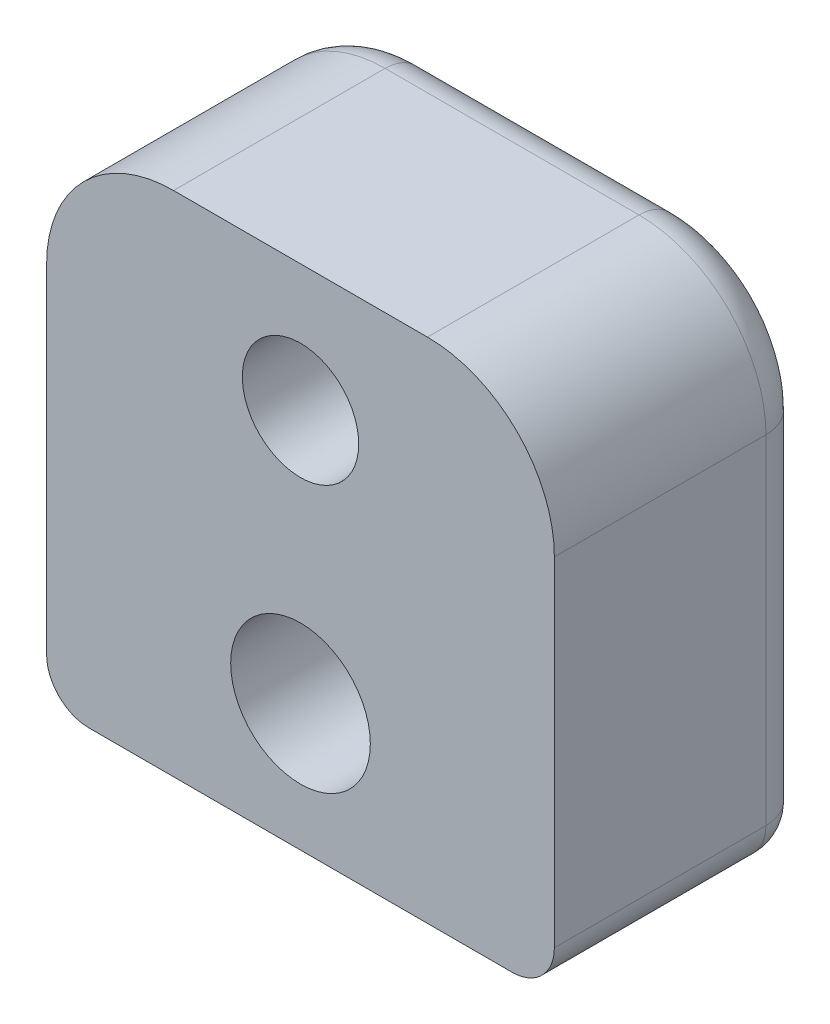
ISO-10303-21;
HEADER;
FILE_DESCRIPTION(('STEP AP214'),'2;1');
FILE_NAME('part.step','',(''),(''),'','','');
FILE_SCHEMA(('AUTOMOTIVE_DESIGN { 1 0 10303 214 1 1 1 1 }'));
ENDSEC;
DATA;
#1=APPLICATION_CONTEXT('core data for automotive mechanical design processes');
#2=APPLICATION_PROTOCOL_DEFINITION('international standard','automotive_design',2000,#1);
#3=PRODUCT_CONTEXT('',#1,'mechanical');
#4=PRODUCT('Part','Part','',(#3));
#5=PRODUCT_RELATED_PRODUCT_CATEGORY('part','',(#4));
#6=PRODUCT_DEFINITION_FORMATION('','',#4);
#7=PRODUCT_DEFINITION_CONTEXT('part definition',#1,'design');
#8=PRODUCT_DEFINITION('design','',#6,#7);
#9=PRODUCT_DEFINITION_SHAPE('','',#8);
#10=(LENGTH_UNIT() NAMED_UNIT(*) SI_UNIT(.MILLI.,.METRE.));
#11=(NAMED_UNIT(*) PLANE_ANGLE_UNIT() SI_UNIT($,.RADIAN.));
#12=(NAMED_UNIT(*) SI_UNIT($,.STERADIAN.) SOLID_ANGLE_UNIT());
#13=UNCERTAINTY_MEASURE_WITH_UNIT(LENGTH_MEASURE(1.E-05),#10,'distance_accuracy_value','');
#14=(GEOMETRIC_REPRESENTATION_CONTEXT(3) GLOBAL_UNCERTAINTY_ASSIGNED_CONTEXT((#13)) GLOBAL_UNIT_ASSIGNED_CONTEXT((#10,
#11,#12)) REPRESENTATION_CONTEXT('',''));
#15=CARTESIAN_POINT('',(0.,0.,0.));
#16=DIRECTION('',(0.,0.,1.));
#17=DIRECTION('',(1.,0.,0.));
#18=AXIS2_PLACEMENT_3D('',#15,#16,#17);
#19=CARTESIAN_POINT('',(0.812499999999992,-8.1875,12.));
#20=DIRECTION('',(0.,0.,-1.));
#21=DIRECTION('',(-1.,0.,0.));
#22=AXIS2_PLACEMENT_3D('',#19,#20,#21);
#23=CYLINDRICAL_SURFACE('',#22,3.3);
#24=CARTESIAN_POINT('',(0.812499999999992,-8.1875,12.));
#25=DIRECTION('',(0.,0.,1.));
#26=DIRECTION('',(1.,0.,0.));
#27=AXIS2_PLACEMENT_3D('',#24,#25,#26);
#28=CIRCLE('',#27,3.3);
#29=CARTESIAN_POINT('',(4.11249999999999,-8.1875,12.));
#30=VERTEX_POINT('',#29);
#31=EDGE_CURVE('E379',#30,#30,#28,.T.);
#32=ORIENTED_EDGE('',*,*,#31,.T.);
#33=EDGE_LOOP('',(#32));
#34=FACE_BOUND('',#33,.T.);
#35=CARTESIAN_POINT('',(0.812499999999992,-8.1875,7.));
#36=DIRECTION('',(0.,0.,-1.));
#37=DIRECTION('',(-1.,0.,0.));
#38=AXIS2_PLACEMENT_3D('',#35,#36,#37);
#39=CIRCLE('',#38,3.3);
#40=CARTESIAN_POINT('',(-2.48750000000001,-8.1875,7.));
#41=VERTEX_POINT('',#40);
#42=EDGE_CURVE('E45',#41,#41,#39,.T.);
#43=ORIENTED_EDGE('',*,*,#42,.T.);
#44=EDGE_LOOP('',(#43));
#45=FACE_BOUND('',#44,.T.);
#46=ADVANCED_FACE('F41',(#34,#45),#23,.F.);
#47=CARTESIAN_POINT('',(6.81249999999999,3.8125,12.));
#48=DIRECTION('',(0.,0.,-1.));
#49=DIRECTION('',(-1.,0.,0.));
#50=AXIS2_PLACEMENT_3D('',#47,#48,#49);
#51=PLANE('',#50);
#52=CARTESIAN_POINT('',(6.81249999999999,3.8125,12.));
#53=DIRECTION('',(0.,0.,1.));
#54=DIRECTION('',(-1.,0.,0.));
#55=AXIS2_PLACEMENT_3D('',#52,#53,#54);
#56=CIRCLE('',#55,6.);
#57=CARTESIAN_POINT('',(12.8125,3.81249999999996,12.));
#58=VERTEX_POINT('',#57);
#59=CARTESIAN_POINT('',(6.81249999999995,9.8125,12.));
#60=VERTEX_POINT('',#59);
#61=EDGE_CURVE('E376',#58,#60,#56,.T.);
#62=ORIENTED_EDGE('',*,*,#61,.T.);
#63=DIRECTION('',(-1.,0.,0.));
#64=VECTOR('',#63,1.);
#65=CARTESIAN_POINT('',(-5.18749999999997,9.8125,12.));
#66=LINE('',#65,#64);
#67=CARTESIAN_POINT('',(-5.18749999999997,9.8125,12.));
#68=VERTEX_POINT('',#67);
#69=EDGE_CURVE('E289',#60,#68,#66,.T.);
#70=ORIENTED_EDGE('',*,*,#69,.T.);
#71=CARTESIAN_POINT('',(-5.18750000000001,3.8125,12.));
#72=DIRECTION('',(0.,0.,1.));
#73=DIRECTION('',(1.,0.,0.));
#74=AXIS2_PLACEMENT_3D('',#71,#72,#73);
#75=CIRCLE('',#74,6.);
#76=CARTESIAN_POINT('',(-11.1875,3.81249999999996,12.));
#77=VERTEX_POINT('',#76);
#78=EDGE_CURVE('E371',#68,#77,#75,.T.);
#79=ORIENTED_EDGE('',*,*,#78,.T.);
#80=DIRECTION('',(0.,-1.,0.));
#81=VECTOR('',#80,1.);
#82=CARTESIAN_POINT('',(-11.1875,3.81249999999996,12.));
#83=LINE('',#82,#81);
#84=CARTESIAN_POINT('',(-11.1875,-12.1875,12.));
#85=VERTEX_POINT('',#84);
#86=EDGE_CURVE('E312',#77,#85,#83,.T.);
#87=ORIENTED_EDGE('',*,*,#86,.T.);
#88=CARTESIAN_POINT('',(-9.18750000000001,-12.1875,12.));
#89=DIRECTION('',(0.,0.,1.));
#90=DIRECTION('',(1.,0.,0.));
#91=AXIS2_PLACEMENT_3D('',#88,#89,#90);
#92=CIRCLE('',#91,2.);
#93=CARTESIAN_POINT('',(-9.18749999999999,-14.1875,12.));
#94=VERTEX_POINT('',#93);
#95=EDGE_CURVE('E366',#85,#94,#92,.T.);
#96=ORIENTED_EDGE('',*,*,#95,.T.);
#97=DIRECTION('',(1.,0.,0.));
#98=VECTOR('',#97,1.);
#99=CARTESIAN_POINT('',(-9.18749999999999,-14.1875,12.));
#100=LINE('',#99,#98);
#101=CARTESIAN_POINT('',(10.8125,-14.1875,12.));
#102=VERTEX_POINT('',#101);
#103=EDGE_CURVE('E347',#94,#102,#100,.T.);
#104=ORIENTED_EDGE('',*,*,#103,.T.);
#105=CARTESIAN_POINT('',(10.8125,-12.1875,12.));
#106=DIRECTION('',(0.,0.,1.));
#107=DIRECTION('',(1.,0.,0.));
#108=AXIS2_PLACEMENT_3D('',#105,#106,#107);
#109=CIRCLE('',#108,2.);
#110=CARTESIAN_POINT('',(12.8125,-12.1875,12.));
#111=VERTEX_POINT('',#110);
#112=EDGE_CURVE('E361',#102,#111,#109,.T.);
#113=ORIENTED_EDGE('',*,*,#112,.T.);
#114=DIRECTION('',(0.,1.,0.));
#115=VECTOR('',#114,1.);
#116=CARTESIAN_POINT('',(12.8125,3.81249999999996,12.));
#117=LINE('',#116,#115);
#118=EDGE_CURVE('E358',#111,#58,#117,.T.);
#119=ORIENTED_EDGE('',*,*,#118,.T.);
#120=EDGE_LOOP('',(#62,#70,#79,#87,#96,#104,#113,#119));
#121=FACE_BOUND('',#120,.T.);
#122=ORIENTED_EDGE('',*,*,#31,.F.);
#123=EDGE_LOOP('',(#122));
#124=FACE_BOUND('',#123,.T.);
#125=CARTESIAN_POINT('',(0.812499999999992,3.8125,12.));
#126=DIRECTION('',(0.,0.,1.));
#127=DIRECTION('',(1.,0.,0.));
#128=AXIS2_PLACEMENT_3D('',#125,#126,#127);
#129=CIRCLE('',#128,2.75);
#130=CARTESIAN_POINT('',(3.56249999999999,3.8125,12.));
#131=VERTEX_POINT('',#130);
#132=EDGE_CURVE('E383',#131,#131,#129,.T.);
#133=ORIENTED_EDGE('',*,*,#132,.F.);
#134=EDGE_LOOP('',(#133));
#135=FACE_BOUND('',#134,.T.);
#136=ADVANCED_FACE('F225',(#121,#124,#135),#51,.F.);
#137=CARTESIAN_POINT('',(6.81249999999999,3.8125,0.));
#138=DIRECTION('',(0.,0.,-1.));
#139=DIRECTION('',(-1.,0.,0.));
#140=AXIS2_PLACEMENT_3D('',#137,#138,#139);
#141=PLANE('',#140);
#142=CARTESIAN_POINT('',(0.812499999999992,-8.1875,0.));
#143=DIRECTION('',(0.,0.,-1.));
#144=DIRECTION('',(-1.,0.,0.));
#145=AXIS2_PLACEMENT_3D('',#142,#143,#144);
#146=CIRCLE('',#145,5.5);
#147=CARTESIAN_POINT('',(-2.96241721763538,-12.1875,0.));
#148=VERTEX_POINT('',#147);
#149=CARTESIAN_POINT('',(4.58741721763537,-12.1875,0.));
#150=VERTEX_POINT('',#149);
#151=EDGE_CURVE('E56',#148,#150,#146,.T.);
#152=ORIENTED_EDGE('',*,*,#151,.F.);
#153=DIRECTION('',(1.,0.,0.));
#154=VECTOR('',#153,1.);
#155=CARTESIAN_POINT('',(-9.18749999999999,-12.1875,0.));
#156=LINE('',#155,#154);
#157=CARTESIAN_POINT('',(-9.18750000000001,-12.1875,0.));
#158=VERTEX_POINT('',#157);
#159=EDGE_CURVE('E138',#148,#158,#156,.F.);
#160=ORIENTED_EDGE('',*,*,#159,.T.);
#161=DIRECTION('',(0.,-1.,0.));
#162=VECTOR('',#161,1.);
#163=CARTESIAN_POINT('',(-9.18750000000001,3.81249999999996,0.));
#164=LINE('',#163,#162);
#165=CARTESIAN_POINT('',(-9.18750000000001,3.81249999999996,0.));
#166=VERTEX_POINT('',#165);
#167=EDGE_CURVE('E150',#158,#166,#164,.F.);
#168=ORIENTED_EDGE('',*,*,#167,.T.);
#169=CARTESIAN_POINT('',(-5.18750000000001,3.8125,0.));
#170=DIRECTION('',(0.,0.,-1.));
#171=DIRECTION('',(-1.,0.,0.));
#172=AXIS2_PLACEMENT_3D('',#169,#170,#171);
#173=CIRCLE('',#172,4.);
#174=CARTESIAN_POINT('',(-5.18749999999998,7.8125,0.));
#175=VERTEX_POINT('',#174);
#176=EDGE_CURVE('E155',#166,#175,#173,.T.);
#177=ORIENTED_EDGE('',*,*,#176,.T.);
#178=DIRECTION('',(-1.,0.,0.));
#179=VECTOR('',#178,1.);
#180=CARTESIAN_POINT('',(6.81249999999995,7.8125,0.));
#181=LINE('',#180,#179);
#182=CARTESIAN_POINT('',(6.81249999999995,7.8125,0.));
#183=VERTEX_POINT('',#182);
#184=EDGE_CURVE('E299',#175,#183,#181,.F.);
#185=ORIENTED_EDGE('',*,*,#184,.T.);
#186=CARTESIAN_POINT('',(6.81249999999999,3.8125,0.));
#187=DIRECTION('',(0.,0.,-1.));
#188=DIRECTION('',(-1.,0.,0.));
#189=AXIS2_PLACEMENT_3D('',#186,#187,#188);
#190=CIRCLE('',#189,4.);
#191=CARTESIAN_POINT('',(10.8125,3.81249999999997,0.));
#192=VERTEX_POINT('',#191);
#193=EDGE_CURVE('E279',#183,#192,#190,.T.);
#194=ORIENTED_EDGE('',*,*,#193,.T.);
#195=DIRECTION('',(0.,1.,0.));
#196=VECTOR('',#195,1.);
#197=CARTESIAN_POINT('',(10.8125,-12.1875,0.));
#198=LINE('',#197,#196);
#199=CARTESIAN_POINT('',(10.8125,-12.1875,0.));
#200=VERTEX_POINT('',#199);
#201=EDGE_CURVE('E275',#192,#200,#198,.F.);
#202=ORIENTED_EDGE('',*,*,#201,.T.);
#203=EDGE_CURVE('E140',#200,#150,#156,.F.);
#204=ORIENTED_EDGE('',*,*,#203,.T.);
#205=EDGE_LOOP('',(#152,#160,#168,#177,#185,#194,#202,#204));
#206=FACE_BOUND('',#205,.T.);
#207=CARTESIAN_POINT('',(0.812499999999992,3.8125,0.));
#208=DIRECTION('',(0.,0.,1.));
#209=DIRECTION('',(1.,0.,0.));
#210=AXIS2_PLACEMENT_3D('',#207,#208,#209);
#211=CIRCLE('',#210,2.75);
#212=CARTESIAN_POINT('',(3.56249999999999,3.8125,0.));
#213=VERTEX_POINT('',#212);
#214=EDGE_CURVE('E202',#213,#213,#211,.T.);
#215=ORIENTED_EDGE('',*,*,#214,.T.);
#216=EDGE_LOOP('',(#215));
#217=FACE_BOUND('',#216,.T.);
#218=ADVANCED_FACE('F136',(#206,#217),#141,.T.);
#219=CARTESIAN_POINT('',(6.81249999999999,3.8125,12.));
#220=DIRECTION('',(0.,0.,-1.));
#221=DIRECTION('',(-1.,0.,0.));
#222=AXIS2_PLACEMENT_3D('',#219,#220,#221);
#223=CYLINDRICAL_SURFACE('',#222,6.);
#224=DIRECTION('',(0.,0.,-1.));
#225=VECTOR('',#224,1.);
#226=CARTESIAN_POINT('',(12.8125,3.81249999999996,12.));
#227=LINE('',#226,#225);
#228=CARTESIAN_POINT('',(12.8125,3.81249999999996,2.));
#229=VERTEX_POINT('',#228);
#230=EDGE_CURVE('E285',#58,#229,#227,.T.);
#231=ORIENTED_EDGE('',*,*,#230,.T.);
#232=CARTESIAN_POINT('',(6.81249999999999,3.8125,2.));
#233=DIRECTION('',(0.,0.,-1.));
#234=DIRECTION('',(-1.,0.,0.));
#235=AXIS2_PLACEMENT_3D('',#232,#233,#234);
#236=CIRCLE('',#235,6.);
#237=CARTESIAN_POINT('',(6.81249999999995,9.8125,2.));
#238=VERTEX_POINT('',#237);
#239=EDGE_CURVE('E170',#229,#238,#236,.F.);
#240=ORIENTED_EDGE('',*,*,#239,.T.);
#241=DIRECTION('',(0.,0.,-1.));
#242=VECTOR('',#241,1.);
#243=CARTESIAN_POINT('',(6.81249999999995,9.8125,12.));
#244=LINE('',#243,#242);
#245=EDGE_CURVE('E284',#60,#238,#244,.T.);
#246=ORIENTED_EDGE('',*,*,#245,.F.);
#247=ORIENTED_EDGE('',*,*,#61,.F.);
#248=EDGE_LOOP('',(#231,#240,#246,#247));
#249=FACE_BOUND('',#248,.T.);
#250=ADVANCED_FACE('F232',(#249),#223,.T.);
#251=CARTESIAN_POINT('',(-5.18749999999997,9.8125,12.));
#252=DIRECTION('',(0.,-1.,0.));
#253=DIRECTION('',(1.,0.,0.));
#254=AXIS2_PLACEMENT_3D('',#251,#252,#253);
#255=PLANE('',#254);
#256=ORIENTED_EDGE('',*,*,#245,.T.);
#257=DIRECTION('',(-1.,0.,0.));
#258=VECTOR('',#257,1.);
#259=CARTESIAN_POINT('',(-5.18749999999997,9.8125,2.));
#260=LINE('',#259,#258);
#261=CARTESIAN_POINT('',(-5.18749999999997,9.8125,2.));
#262=VERTEX_POINT('',#261);
#263=EDGE_CURVE('E167',#238,#262,#260,.T.);
#264=ORIENTED_EDGE('',*,*,#263,.T.);
#265=DIRECTION('',(0.,0.,-1.));
#266=VECTOR('',#265,1.);
#267=CARTESIAN_POINT('',(-5.18749999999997,9.8125,12.));
#268=LINE('',#267,#266);
#269=EDGE_CURVE('E293',#68,#262,#268,.T.);
#270=ORIENTED_EDGE('',*,*,#269,.F.);
#271=ORIENTED_EDGE('',*,*,#69,.F.);
#272=EDGE_LOOP('',(#256,#264,#270,#271));
#273=FACE_BOUND('',#272,.T.);
#274=ADVANCED_FACE('F254',(#273),#255,.F.);
#275=CARTESIAN_POINT('',(-5.18750000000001,3.8125,12.));
#276=DIRECTION('',(0.,0.,-1.));
#277=DIRECTION('',(-1.,0.,0.));
#278=AXIS2_PLACEMENT_3D('',#275,#276,#277);
#279=CYLINDRICAL_SURFACE('',#278,6.);
#280=ORIENTED_EDGE('',*,*,#269,.T.);
#281=CARTESIAN_POINT('',(-5.18750000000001,3.8125,2.));
#282=DIRECTION('',(0.,0.,-1.));
#283=DIRECTION('',(-1.,0.,0.));
#284=AXIS2_PLACEMENT_3D('',#281,#282,#283);
#285=CIRCLE('',#284,6.);
#286=CARTESIAN_POINT('',(-11.1875,3.81249999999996,2.));
#287=VERTEX_POINT('',#286);
#288=EDGE_CURVE('E164',#262,#287,#285,.F.);
#289=ORIENTED_EDGE('',*,*,#288,.T.);
#290=DIRECTION('',(0.,0.,-1.));
#291=VECTOR('',#290,1.);
#292=CARTESIAN_POINT('',(-11.1875,3.81249999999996,12.));
#293=LINE('',#292,#291);
#294=EDGE_CURVE('E308',#77,#287,#293,.T.);
#295=ORIENTED_EDGE('',*,*,#294,.F.);
#296=ORIENTED_EDGE('',*,*,#78,.F.);
#297=EDGE_LOOP('',(#280,#289,#295,#296));
#298=FACE_BOUND('',#297,.T.);
#299=ADVANCED_FACE('F250',(#298),#279,.T.);
#300=CARTESIAN_POINT('',(-11.1875,3.81249999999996,12.));
#301=DIRECTION('',(1.,0.,0.));
#302=DIRECTION('',(0.,0.,-1.));
#303=AXIS2_PLACEMENT_3D('',#300,#301,#302);
#304=PLANE('',#303);
#305=ORIENTED_EDGE('',*,*,#294,.T.);
#306=DIRECTION('',(0.,-1.,0.));
#307=VECTOR('',#306,1.);
#308=CARTESIAN_POINT('',(-11.1875,-12.1875,2.));
#309=LINE('',#308,#307);
#310=CARTESIAN_POINT('',(-11.1875,-12.1875,2.));
#311=VERTEX_POINT('',#310);
#312=EDGE_CURVE('E161',#287,#311,#309,.T.);
#313=ORIENTED_EDGE('',*,*,#312,.T.);
#314=DIRECTION('',(0.,0.,-1.));
#315=VECTOR('',#314,1.);
#316=CARTESIAN_POINT('',(-11.1875,-12.1875,12.));
#317=LINE('',#316,#315);
#318=EDGE_CURVE('E314',#85,#311,#317,.T.);
#319=ORIENTED_EDGE('',*,*,#318,.F.);
#320=ORIENTED_EDGE('',*,*,#86,.F.);
#321=EDGE_LOOP('',(#305,#313,#319,#320));
#322=FACE_BOUND('',#321,.T.);
#323=ADVANCED_FACE('F246',(#322),#304,.F.);
#324=CARTESIAN_POINT('',(-9.18750000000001,-12.1875,12.));
#325=DIRECTION('',(0.,0.,-1.));
#326=DIRECTION('',(-1.,0.,0.));
#327=AXIS2_PLACEMENT_3D('',#324,#325,#326);
#328=CYLINDRICAL_SURFACE('',#327,2.);
#329=ORIENTED_EDGE('',*,*,#318,.T.);
#330=CARTESIAN_POINT('',(-9.18750000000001,-12.1875,2.));
#331=DIRECTION('',(0.,0.,-1.));
#332=DIRECTION('',(-1.,0.,0.));
#333=AXIS2_PLACEMENT_3D('',#330,#331,#332);
#334=CIRCLE('',#333,2.);
#335=CARTESIAN_POINT('',(-9.18749999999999,-14.1875,2.));
#336=VERTEX_POINT('',#335);
#337=EDGE_CURVE('E154',#311,#336,#334,.F.);
#338=ORIENTED_EDGE('',*,*,#337,.T.);
#339=DIRECTION('',(0.,0.,-1.));
#340=VECTOR('',#339,1.);
#341=CARTESIAN_POINT('',(-9.18749999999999,-14.1875,12.));
#342=LINE('',#341,#340);
#343=EDGE_CURVE('E319',#94,#336,#342,.T.);
#344=ORIENTED_EDGE('',*,*,#343,.F.);
#345=ORIENTED_EDGE('',*,*,#95,.F.);
#346=EDGE_LOOP('',(#329,#338,#344,#345));
#347=FACE_BOUND('',#346,.T.);
#348=ADVANCED_FACE('F242',(#347),#328,.T.);
#349=CARTESIAN_POINT('',(-9.18749999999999,-14.1875,12.));
#350=DIRECTION('',(0.,1.,0.));
#351=DIRECTION('',(0.,0.,1.));
#352=AXIS2_PLACEMENT_3D('',#349,#350,#351);
#353=PLANE('',#352);
#354=ORIENTED_EDGE('',*,*,#343,.T.);
#355=DIRECTION('',(1.,0.,0.));
#356=VECTOR('',#355,1.);
#357=CARTESIAN_POINT('',(10.8125,-14.1875,2.));
#358=LINE('',#357,#356);
#359=CARTESIAN_POINT('',(10.8125,-14.1875,2.));
#360=VERTEX_POINT('',#359);
#361=EDGE_CURVE('E325',#336,#360,#358,.T.);
#362=ORIENTED_EDGE('',*,*,#361,.T.);
#363=DIRECTION('',(0.,0.,-1.));
#364=VECTOR('',#363,1.);
#365=CARTESIAN_POINT('',(10.8125,-14.1875,12.));
#366=LINE('',#365,#364);
#367=EDGE_CURVE('E349',#102,#360,#366,.T.);
#368=ORIENTED_EDGE('',*,*,#367,.F.);
#369=ORIENTED_EDGE('',*,*,#103,.F.);
#370=EDGE_LOOP('',(#354,#362,#368,#369));
#371=FACE_BOUND('',#370,.T.);
#372=ADVANCED_FACE('F238',(#371),#353,.F.);
#373=CARTESIAN_POINT('',(10.8125,-12.1875,12.));
#374=DIRECTION('',(0.,0.,-1.));
#375=DIRECTION('',(-1.,0.,0.));
#376=AXIS2_PLACEMENT_3D('',#373,#374,#375);
#377=CYLINDRICAL_SURFACE('',#376,2.);
#378=ORIENTED_EDGE('',*,*,#367,.T.);
#379=CARTESIAN_POINT('',(10.8125,-12.1875,2.));
#380=DIRECTION('',(0.,0.,-1.));
#381=DIRECTION('',(-1.,0.,0.));
#382=AXIS2_PLACEMENT_3D('',#379,#380,#381);
#383=CIRCLE('',#382,2.);
#384=CARTESIAN_POINT('',(12.8125,-12.1875,2.));
#385=VERTEX_POINT('',#384);
#386=EDGE_CURVE('E292',#360,#385,#383,.F.);
#387=ORIENTED_EDGE('',*,*,#386,.T.);
#388=DIRECTION('',(0.,0.,-1.));
#389=VECTOR('',#388,1.);
#390=CARTESIAN_POINT('',(12.8125,-12.1875,12.));
#391=LINE('',#390,#389);
#392=EDGE_CURVE('E351',#111,#385,#391,.T.);
#393=ORIENTED_EDGE('',*,*,#392,.F.);
#394=ORIENTED_EDGE('',*,*,#112,.F.);
#395=EDGE_LOOP('',(#378,#387,#393,#394));
#396=FACE_BOUND('',#395,.T.);
#397=ADVANCED_FACE('F235',(#396),#377,.T.);
#398=CARTESIAN_POINT('',(12.8125,3.81249999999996,12.));
#399=DIRECTION('',(-1.,0.,0.));
#400=DIRECTION('',(0.,-1.,0.));
#401=AXIS2_PLACEMENT_3D('',#398,#399,#400);
#402=PLANE('',#401);
#403=ORIENTED_EDGE('',*,*,#392,.T.);
#404=DIRECTION('',(0.,1.,0.));
#405=VECTOR('',#404,1.);
#406=CARTESIAN_POINT('',(12.8125,3.81249999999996,2.));
#407=LINE('',#406,#405);
#408=EDGE_CURVE('E51',#385,#229,#407,.T.);
#409=ORIENTED_EDGE('',*,*,#408,.T.);
#410=ORIENTED_EDGE('',*,*,#230,.F.);
#411=ORIENTED_EDGE('',*,*,#118,.F.);
#412=EDGE_LOOP('',(#403,#409,#410,#411));
#413=FACE_BOUND('',#412,.T.);
#414=ADVANCED_FACE('F221',(#413),#402,.F.);
#415=CARTESIAN_POINT('',(0.812499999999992,3.8125,12.));
#416=DIRECTION('',(0.,0.,-1.));
#417=DIRECTION('',(-1.,0.,0.));
#418=AXIS2_PLACEMENT_3D('',#415,#416,#417);
#419=CYLINDRICAL_SURFACE('',#418,2.75);
#420=ORIENTED_EDGE('',*,*,#132,.T.);
#421=EDGE_LOOP('',(#420));
#422=FACE_BOUND('',#421,.T.);
#423=ORIENTED_EDGE('',*,*,#214,.F.);
#424=EDGE_LOOP('',(#423));
#425=FACE_BOUND('',#424,.T.);
#426=ADVANCED_FACE('F218',(#422,#425),#419,.F.);
#427=CARTESIAN_POINT('',(-5.18750000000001,3.8125,2.));
#428=DIRECTION('',(0.,0.,-1.));
#429=DIRECTION('',(-1.,0.,0.));
#430=AXIS2_PLACEMENT_3D('',#427,#428,#429);
#431=TOROIDAL_SURFACE('',#430,4.,2.);
#432=CARTESIAN_POINT('',(-5.18749999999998,7.8125,2.));
#433=DIRECTION('',(1.,0.,0.));
#434=DIRECTION('',(0.,1.,0.));
#435=AXIS2_PLACEMENT_3D('',#432,#433,#434);
#436=CIRCLE('',#435,2.);
#437=EDGE_CURVE('E195',#175,#262,#436,.T.);
#438=ORIENTED_EDGE('',*,*,#437,.F.);
#439=ORIENTED_EDGE('',*,*,#176,.F.);
#440=CARTESIAN_POINT('',(-9.18750000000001,3.81249999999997,2.));
#441=DIRECTION('',(0.,-1.,0.));
#442=DIRECTION('',(0.,0.,-1.));
#443=AXIS2_PLACEMENT_3D('',#440,#441,#442);
#444=CIRCLE('',#443,2.);
#445=EDGE_CURVE('E199',#287,#166,#444,.T.);
#446=ORIENTED_EDGE('',*,*,#445,.F.);
#447=ORIENTED_EDGE('',*,*,#288,.F.);
#448=EDGE_LOOP('',(#438,#439,#446,#447));
#449=FACE_BOUND('',#448,.T.);
#450=ADVANCED_FACE('F43',(#449),#431,.T.);
#451=CARTESIAN_POINT('',(-9.18750000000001,3.81249999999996,2.));
#452=DIRECTION('',(0.,1.,0.));
#453=DIRECTION('',(0.,0.,1.));
#454=AXIS2_PLACEMENT_3D('',#451,#452,#453);
#455=CYLINDRICAL_SURFACE('',#454,2.);
#456=ORIENTED_EDGE('',*,*,#445,.T.);
#457=ORIENTED_EDGE('',*,*,#167,.F.);
#458=CARTESIAN_POINT('',(-9.18750000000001,-12.1875,2.));
#459=DIRECTION('',(0.,-1.,0.));
#460=DIRECTION('',(0.,0.,-1.));
#461=AXIS2_PLACEMENT_3D('',#458,#459,#460);
#462=CIRCLE('',#461,2.);
#463=EDGE_CURVE('E192',#311,#158,#462,.T.);
#464=ORIENTED_EDGE('',*,*,#463,.F.);
#465=ORIENTED_EDGE('',*,*,#312,.F.);
#466=EDGE_LOOP('',(#456,#457,#464,#465));
#467=FACE_BOUND('',#466,.T.);
#468=ADVANCED_FACE('F337',(#467),#455,.T.);
#469=CARTESIAN_POINT('',(-5.18749999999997,7.8125,2.));
#470=DIRECTION('',(1.,0.,0.));
#471=DIRECTION('',(0.,1.,0.));
#472=AXIS2_PLACEMENT_3D('',#469,#470,#471);
#473=CYLINDRICAL_SURFACE('',#472,2.);
#474=ORIENTED_EDGE('',*,*,#437,.T.);
#475=ORIENTED_EDGE('',*,*,#263,.F.);
#476=CARTESIAN_POINT('',(6.81249999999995,7.8125,2.));
#477=DIRECTION('',(1.,0.,0.));
#478=DIRECTION('',(0.,0.,-1.));
#479=AXIS2_PLACEMENT_3D('',#476,#477,#478);
#480=CIRCLE('',#479,2.);
#481=EDGE_CURVE('E188',#183,#238,#480,.T.);
#482=ORIENTED_EDGE('',*,*,#481,.F.);
#483=ORIENTED_EDGE('',*,*,#184,.F.);
#484=EDGE_LOOP('',(#474,#475,#482,#483));
#485=FACE_BOUND('',#484,.T.);
#486=ADVANCED_FACE('F296',(#485),#473,.T.);
#487=CARTESIAN_POINT('',(-9.18750000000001,-12.1875,2.));
#488=DIRECTION('',(0.,0.,-1.));
#489=DIRECTION('',(-1.,0.,0.));
#490=AXIS2_PLACEMENT_3D('',#487,#488,#489);
#491=SPHERICAL_SURFACE('',#490,2.);
#492=ORIENTED_EDGE('',*,*,#337,.F.);
#493=ORIENTED_EDGE('',*,*,#463,.T.);
#494=CARTESIAN_POINT('',(-9.18750000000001,-12.1875,2.));
#495=DIRECTION('',(1.,0.,0.));
#496=DIRECTION('',(0.,1.,0.));
#497=AXIS2_PLACEMENT_3D('',#494,#495,#496);
#498=CIRCLE('',#497,2.);
#499=EDGE_CURVE('E147',#336,#158,#498,.T.);
#500=ORIENTED_EDGE('',*,*,#499,.F.);
#501=EDGE_LOOP('',(#492,#493,#500));
#502=FACE_BOUND('',#501,.T.);
#503=ADVANCED_FACE('F340',(#502),#491,.T.);
#504=CARTESIAN_POINT('',(6.81249999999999,3.8125,2.));
#505=DIRECTION('',(0.,0.,-1.));
#506=DIRECTION('',(-1.,0.,0.));
#507=AXIS2_PLACEMENT_3D('',#504,#505,#506);
#508=TOROIDAL_SURFACE('',#507,4.,2.);
#509=ORIENTED_EDGE('',*,*,#481,.T.);
#510=ORIENTED_EDGE('',*,*,#239,.F.);
#511=CARTESIAN_POINT('',(10.8125,3.81249999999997,2.));
#512=DIRECTION('',(0.,-1.,0.));
#513=DIRECTION('',(1.,0.,0.));
#514=AXIS2_PLACEMENT_3D('',#511,#512,#513);
#515=CIRCLE('',#514,2.);
#516=EDGE_CURVE('E182',#192,#229,#515,.T.);
#517=ORIENTED_EDGE('',*,*,#516,.F.);
#518=ORIENTED_EDGE('',*,*,#193,.F.);
#519=EDGE_LOOP('',(#509,#510,#517,#518));
#520=FACE_BOUND('',#519,.T.);
#521=ADVANCED_FACE('F270',(#520),#508,.T.);
#522=CARTESIAN_POINT('',(-9.18749999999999,-12.1875,2.));
#523=DIRECTION('',(-1.,0.,0.));
#524=DIRECTION('',(0.,0.,1.));
#525=AXIS2_PLACEMENT_3D('',#522,#523,#524);
#526=CYLINDRICAL_SURFACE('',#525,2.);
#527=CARTESIAN_POINT('',(4.58741721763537,-12.1875,0.));
#528=CARTESIAN_POINT('',(4.50533231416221,-12.2649898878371,2.73386857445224E-05));
#529=CARTESIAN_POINT('',(4.42092822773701,-12.3398435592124,0.00449913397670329));
#530=CARTESIAN_POINT('',(4.24827033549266,-12.4837815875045,0.0207385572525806));
#531=CARTESIAN_POINT('',(4.1600246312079,-12.5528772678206,0.0324914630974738));
#532=CARTESIAN_POINT('',(3.98051732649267,-12.6848374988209,0.0616509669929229));
#533=CARTESIAN_POINT('',(3.88927008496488,-12.747727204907,0.0790334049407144));
#534=CARTESIAN_POINT('',(3.70376902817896,-12.867538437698,0.118106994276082));
#535=CARTESIAN_POINT('',(3.60951337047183,-12.9244562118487,0.139800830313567));
#536=CARTESIAN_POINT('',(3.37682690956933,-13.0556624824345,0.196288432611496));
#537=CARTESIAN_POINT('',(3.23698255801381,-13.1267649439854,0.232680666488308));
#538=CARTESIAN_POINT('',(2.95230187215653,-13.2565969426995,0.308058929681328));
#539=CARTESIAN_POINT('',(2.80746330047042,-13.3153208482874,0.347046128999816));
#540=CARTESIAN_POINT('',(2.51290690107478,-13.4203856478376,0.423857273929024));
#541=CARTESIAN_POINT('',(2.36318504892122,-13.4667160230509,0.461680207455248));
#542=CARTESIAN_POINT('',(2.05915086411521,-13.5466537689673,0.531826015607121));
#543=CARTESIAN_POINT('',(1.90484173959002,-13.5802698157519,0.56415263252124));
#544=CARTESIAN_POINT('',(1.64062886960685,-13.6258988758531,0.610139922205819));
#545=CARTESIAN_POINT('',(1.53179084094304,-13.641378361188,0.626480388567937));
#546=CARTESIAN_POINT('',(1.31262345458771,-13.6658230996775,0.652822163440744));
#547=CARTESIAN_POINT('',(1.20229451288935,-13.6747901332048,0.662825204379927));
#548=CARTESIAN_POINT('',(0.981268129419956,-13.6860192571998,0.675419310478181));
#549=CARTESIAN_POINT('',(0.870573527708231,-13.6883058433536,0.678037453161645));
#550=CARTESIAN_POINT('',(0.649326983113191,-13.6861920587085,0.675642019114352));
#551=CARTESIAN_POINT('',(0.53877504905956,-13.681791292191,0.670627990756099));
#552=CARTESIAN_POINT('',(0.319232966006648,-13.6664362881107,0.653569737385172));
#553=CARTESIAN_POINT('',(0.210237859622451,-13.6555137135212,0.641559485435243));
#554=CARTESIAN_POINT('',(-0.00615937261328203,-13.627326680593,0.611721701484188));
#555=CARTESIAN_POINT('',(-0.113560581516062,-13.6100587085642,0.593890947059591));
#556=CARTESIAN_POINT('',(-0.32685023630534,-13.5692958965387,0.553812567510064));
#557=CARTESIAN_POINT('',(-0.432729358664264,-13.545772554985,0.531544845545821));
#558=CARTESIAN_POINT('',(-0.64228167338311,-13.4927137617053,0.484189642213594));
#559=CARTESIAN_POINT('',(-0.745955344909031,-13.463179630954,0.459102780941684));
#560=CARTESIAN_POINT('',(-0.969668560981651,-13.3923075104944,0.402866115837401));
#561=CARTESIAN_POINT('',(-1.08927105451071,-13.3498004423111,0.371441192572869));
#562=CARTESIAN_POINT('',(-1.32528085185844,-13.2566227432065,0.308807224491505));
#563=CARTESIAN_POINT('',(-1.44168761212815,-13.2059507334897,0.277598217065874));
#564=CARTESIAN_POINT('',(-1.78493570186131,-13.0421214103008,0.187513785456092));
#565=CARTESIAN_POINT('',(-2.0070896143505,-12.9167443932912,0.131815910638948));
#566=CARTESIAN_POINT('',(-2.35125918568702,-12.6891630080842,0.0618441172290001));
#567=CARTESIAN_POINT('',(-2.47843478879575,-12.5970974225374,0.039889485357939));
#568=CARTESIAN_POINT('',(-2.66398604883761,-12.4501654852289,0.0166995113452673));
#569=CARTESIAN_POINT('',(-2.72513254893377,-12.3995608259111,0.0105898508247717));
#570=CARTESIAN_POINT('',(-2.84538145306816,-12.2955700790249,0.00224120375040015));
#571=CARTESIAN_POINT('',(-2.90448188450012,-12.2421814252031,5.85586230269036E-06));
#572=CARTESIAN_POINT('',(-2.96241721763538,-12.1875,0.));
#573=B_SPLINE_CURVE_WITH_KNOTS('',3,(#527,#528,#529,#530,#531,#532,#533,#534,#535,#536,#537,
#538,#539,#540,#541,#542,#543,#544,#545,#546,#547,#548,#549,#550,#551,#552,#553,#554,#555,#556,
#557,#558,#559,#560,#561,#562,#563,#564,#565,#566,#567,#568,#569,#570,#571,#572),.UNSPECIFIED.,
.F.,.F.,(4,2,2,2,2,2,2,2,2,2,2,2,2,2,2,2,2,2,2,2,2,2,4),(0.,0.338332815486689,0.675983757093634,
1.01220439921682,1.34863506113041,1.83111993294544,2.31382383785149,2.79693613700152,
3.27971816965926,3.61281632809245,3.94582338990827,4.27760784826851,4.60941194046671,
4.93961809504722,5.27000737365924,5.60192860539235,5.93377697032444,6.325734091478,
6.71775747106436,7.49764670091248,7.97227110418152,8.21093131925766,8.44981555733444),.UNSPECIFIED.);
#574=EDGE_CURVE('E11',#150,#148,#573,.T.);
#575=ORIENTED_EDGE('',*,*,#574,.F.);
#576=ORIENTED_EDGE('',*,*,#203,.F.);
#577=CARTESIAN_POINT('',(10.8125,-12.1875,2.));
#578=DIRECTION('',(1.,0.,0.));
#579=DIRECTION('',(0.,0.,-1.));
#580=AXIS2_PLACEMENT_3D('',#577,#578,#579);
#581=CIRCLE('',#580,2.);
#582=EDGE_CURVE('E178',#360,#200,#581,.T.);
#583=ORIENTED_EDGE('',*,*,#582,.F.);
#584=ORIENTED_EDGE('',*,*,#361,.F.);
#585=ORIENTED_EDGE('',*,*,#499,.T.);
#586=ORIENTED_EDGE('',*,*,#159,.F.);
#587=EDGE_LOOP('',(#575,#576,#583,#584,#585,#586));
#588=FACE_BOUND('',#587,.T.);
#589=ADVANCED_FACE('F144',(#588),#526,.T.);
#590=CARTESIAN_POINT('',(10.8125,3.81249999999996,2.));
#591=DIRECTION('',(0.,-1.,0.));
#592=DIRECTION('',(1.,0.,0.));
#593=AXIS2_PLACEMENT_3D('',#590,#591,#592);
#594=CYLINDRICAL_SURFACE('',#593,2.);
#595=ORIENTED_EDGE('',*,*,#516,.T.);
#596=ORIENTED_EDGE('',*,*,#408,.F.);
#597=CARTESIAN_POINT('',(10.8125,-12.1875,2.));
#598=DIRECTION('',(0.,-1.,0.));
#599=DIRECTION('',(0.,0.,-1.));
#600=AXIS2_PLACEMENT_3D('',#597,#598,#599);
#601=CIRCLE('',#600,2.);
#602=EDGE_CURVE('E175',#200,#385,#601,.T.);
#603=ORIENTED_EDGE('',*,*,#602,.F.);
#604=ORIENTED_EDGE('',*,*,#201,.F.);
#605=EDGE_LOOP('',(#595,#596,#603,#604));
#606=FACE_BOUND('',#605,.T.);
#607=ADVANCED_FACE('F263',(#606),#594,.T.);
#608=CARTESIAN_POINT('',(10.8125,-12.1875,2.));
#609=DIRECTION('',(0.,0.,-1.));
#610=DIRECTION('',(-1.,0.,0.));
#611=AXIS2_PLACEMENT_3D('',#608,#609,#610);
#612=SPHERICAL_SURFACE('',#611,2.);
#613=ORIENTED_EDGE('',*,*,#386,.F.);
#614=ORIENTED_EDGE('',*,*,#582,.T.);
#615=ORIENTED_EDGE('',*,*,#602,.T.);
#616=EDGE_LOOP('',(#613,#614,#615));
#617=FACE_BOUND('',#616,.T.);
#618=ADVANCED_FACE('F217',(#617),#612,.T.);
#619=CARTESIAN_POINT('',(0.812499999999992,-8.1875,7.));
#620=DIRECTION('',(0.,0.,-1.));
#621=DIRECTION('',(-1.,0.,0.));
#622=AXIS2_PLACEMENT_3D('',#619,#620,#621);
#623=CYLINDRICAL_SURFACE('',#622,5.5);
#624=ORIENTED_EDGE('',*,*,#574,.T.);
#625=ORIENTED_EDGE('',*,*,#151,.T.);
#626=EDGE_LOOP('',(#624,#625));
#627=FACE_BOUND('',#626,.T.);
#628=CARTESIAN_POINT('',(0.812499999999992,-8.1875,7.));
#629=DIRECTION('',(0.,0.,-1.));
#630=DIRECTION('',(-1.,0.,0.));
#631=AXIS2_PLACEMENT_3D('',#628,#629,#630);
#632=CIRCLE('',#631,5.5);
#633=CARTESIAN_POINT('',(-4.68750000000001,-8.1875,7.));
#634=VERTEX_POINT('',#633);
#635=EDGE_CURVE('E142',#634,#634,#632,.T.);
#636=ORIENTED_EDGE('',*,*,#635,.F.);
#637=EDGE_LOOP('',(#636));
#638=FACE_BOUND('',#637,.T.);
#639=ADVANCED_FACE('F129',(#627,#638),#623,.F.);
#640=CARTESIAN_POINT('',(0.812499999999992,-8.1875,7.));
#641=DIRECTION('',(0.,0.,-1.));
#642=DIRECTION('',(-1.,0.,0.));
#643=AXIS2_PLACEMENT_3D('',#640,#641,#642);
#644=PLANE('',#643);
#645=ORIENTED_EDGE('',*,*,#42,.F.);
#646=EDGE_LOOP('',(#645));
#647=FACE_BOUND('',#646,.T.);
#648=ORIENTED_EDGE('',*,*,#635,.T.);
#649=EDGE_LOOP('',(#648));
#650=FACE_BOUND('',#649,.T.);
#651=ADVANCED_FACE('F216',(#647,#650),#644,.T.);
#652=CLOSED_SHELL('',(#46,#136,#218,#250,#274,#299,#323,#348,#372,#397,#414,#426,#450,#468,#486,
#503,#521,#589,#607,#618,#639,#651));
#653=MANIFOLD_SOLID_BREP('B2',#652);
#654=ADVANCED_BREP_SHAPE_REPRESENTATION('',(#18,#653),#14);
#655=SHAPE_DEFINITION_REPRESENTATION(#9,#654);
ENDSEC;
END-ISO-10303-21;
